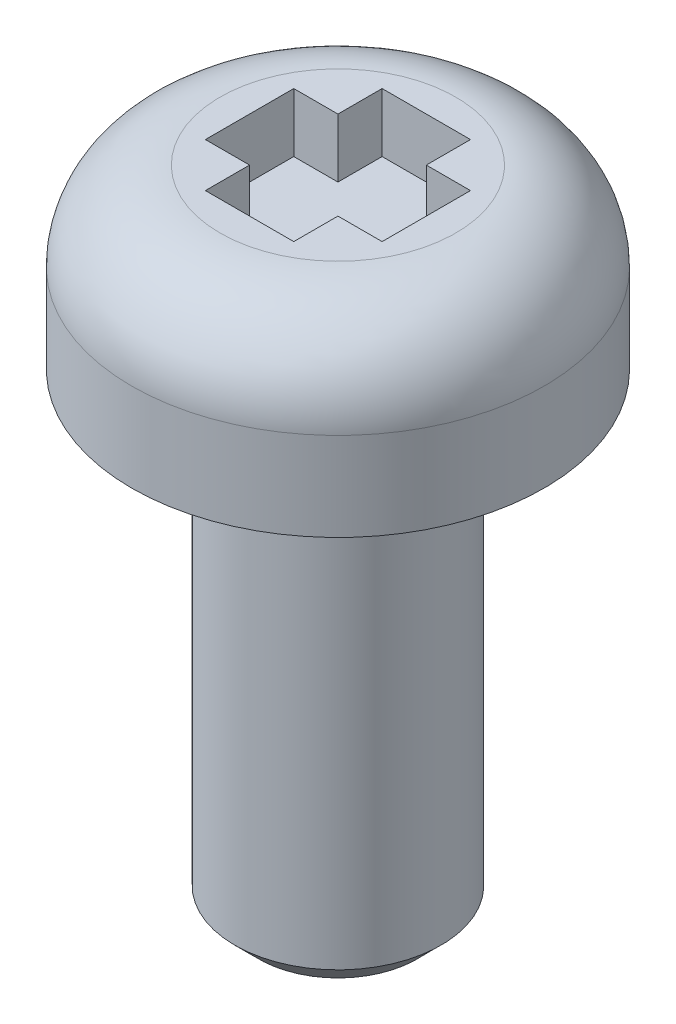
ISO-10303-21;
HEADER;
FILE_DESCRIPTION(('STEP AP214'),'2;1');
FILE_NAME('part.step','',(''),(''),'','','');
FILE_SCHEMA(('AUTOMOTIVE_DESIGN { 1 0 10303 214 1 1 1 1 }'));
ENDSEC;
DATA;
#1=APPLICATION_CONTEXT('core data for automotive mechanical design processes');
#2=APPLICATION_PROTOCOL_DEFINITION('international standard','automotive_design',2000,#1);
#3=PRODUCT_CONTEXT('',#1,'mechanical');
#4=PRODUCT('Part','Part','',(#3));
#5=PRODUCT_RELATED_PRODUCT_CATEGORY('part','',(#4));
#6=PRODUCT_DEFINITION_FORMATION('','',#4);
#7=PRODUCT_DEFINITION_CONTEXT('part definition',#1,'design');
#8=PRODUCT_DEFINITION('design','',#6,#7);
#9=PRODUCT_DEFINITION_SHAPE('','',#8);
#10=(LENGTH_UNIT() NAMED_UNIT(*) SI_UNIT(.MILLI.,.METRE.));
#11=(NAMED_UNIT(*) PLANE_ANGLE_UNIT() SI_UNIT($,.RADIAN.));
#12=(NAMED_UNIT(*) SI_UNIT($,.STERADIAN.) SOLID_ANGLE_UNIT());
#13=UNCERTAINTY_MEASURE_WITH_UNIT(LENGTH_MEASURE(1.E-05),#10,'distance_accuracy_value','');
#14=(GEOMETRIC_REPRESENTATION_CONTEXT(3) GLOBAL_UNCERTAINTY_ASSIGNED_CONTEXT((#13)) GLOBAL_UNIT_ASSIGNED_CONTEXT((#10,
#11,#12)) REPRESENTATION_CONTEXT('',''));
#15=CARTESIAN_POINT('',(0.,0.,0.));
#16=DIRECTION('',(0.,0.,1.));
#17=DIRECTION('',(1.,0.,0.));
#18=AXIS2_PLACEMENT_3D('',#15,#16,#17);
#19=CARTESIAN_POINT('',(-3.5,0.,0.));
#20=DIRECTION('',(0.,1.,0.));
#21=DIRECTION('',(0.,0.,1.));
#22=AXIS2_PLACEMENT_3D('',#19,#20,#21);
#23=PLANE('',#22);
#24=CARTESIAN_POINT('',(0.,0.,0.));
#25=DIRECTION('',(0.,-1.,0.));
#26=DIRECTION('',(0.,0.,1.));
#27=AXIS2_PLACEMENT_3D('',#24,#25,#26);
#28=CIRCLE('',#27,2.2072);
#29=CARTESIAN_POINT('',(0.,0.,2.2072));
#30=VERTEX_POINT('',#29);
#31=EDGE_CURVE('E219',#30,#30,#28,.T.);
#32=ORIENTED_EDGE('',*,*,#31,.F.);
#33=EDGE_LOOP('',(#32));
#34=FACE_BOUND('',#33,.T.);
#35=CARTESIAN_POINT('',(0.,0.,0.));
#36=DIRECTION('',(0.,-1.,0.));
#37=DIRECTION('',(0.,0.,1.));
#38=AXIS2_PLACEMENT_3D('',#35,#36,#37);
#39=CIRCLE('',#38,3.5);
#40=CARTESIAN_POINT('',(0.,0.,3.5));
#41=VERTEX_POINT('',#40);
#42=EDGE_CURVE('E213',#41,#41,#39,.T.);
#43=ORIENTED_EDGE('',*,*,#42,.T.);
#44=EDGE_LOOP('',(#43));
#45=FACE_BOUND('',#44,.T.);
#46=ADVANCED_FACE('F30',(#34,#45),#23,.F.);
#47=CARTESIAN_POINT('',(-0.750000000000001,2.,1.5));
#48=DIRECTION('',(-1.,0.,0.));
#49=DIRECTION('',(0.,0.,-1.));
#50=AXIS2_PLACEMENT_3D('',#47,#48,#49);
#51=PLANE('',#50);
#52=DIRECTION('',(0.,1.,0.));
#53=VECTOR('',#52,1.);
#54=CARTESIAN_POINT('',(-0.75,2.,0.749999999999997));
#55=LINE('',#54,#53);
#56=CARTESIAN_POINT('',(-0.750000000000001,2.,0.749999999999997));
#57=VERTEX_POINT('',#56);
#58=CARTESIAN_POINT('',(-0.75,3.,0.749999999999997));
#59=VERTEX_POINT('',#58);
#60=EDGE_CURVE('E167',#57,#59,#55,.T.);
#61=ORIENTED_EDGE('',*,*,#60,.T.);
#62=DIRECTION('',(0.,0.,-1.));
#63=VECTOR('',#62,1.);
#64=CARTESIAN_POINT('',(-0.750000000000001,3.,1.5));
#65=LINE('',#64,#63);
#66=CARTESIAN_POINT('',(-0.750000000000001,3.,1.5));
#67=VERTEX_POINT('',#66);
#68=EDGE_CURVE('E186',#67,#59,#65,.T.);
#69=ORIENTED_EDGE('',*,*,#68,.F.);
#70=DIRECTION('',(0.,1.,0.));
#71=VECTOR('',#70,1.);
#72=CARTESIAN_POINT('',(-0.750000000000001,2.,1.5));
#73=LINE('',#72,#71);
#74=CARTESIAN_POINT('',(-0.750000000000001,2.,1.5));
#75=VERTEX_POINT('',#74);
#76=EDGE_CURVE('E198',#75,#67,#73,.T.);
#77=ORIENTED_EDGE('',*,*,#76,.F.);
#78=DIRECTION('',(0.,0.,-1.));
#79=VECTOR('',#78,1.);
#80=CARTESIAN_POINT('',(-0.750000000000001,2.,1.5));
#81=LINE('',#80,#79);
#82=EDGE_CURVE('E174',#75,#57,#81,.T.);
#83=ORIENTED_EDGE('',*,*,#82,.T.);
#84=EDGE_LOOP('',(#61,#69,#77,#83));
#85=FACE_BOUND('',#84,.T.);
#86=ADVANCED_FACE('F239',(#85),#51,.F.);
#87=CARTESIAN_POINT('',(0.749999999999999,2.,1.5));
#88=DIRECTION('',(-1.,0.,0.));
#89=DIRECTION('',(0.,0.,-1.));
#90=AXIS2_PLACEMENT_3D('',#87,#88,#89);
#91=PLANE('',#90);
#92=DIRECTION('',(0.,0.,-1.));
#93=VECTOR('',#92,1.);
#94=CARTESIAN_POINT('',(0.749999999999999,2.,1.5));
#95=LINE('',#94,#93);
#96=CARTESIAN_POINT('',(0.749999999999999,2.,1.5));
#97=VERTEX_POINT('',#96);
#98=CARTESIAN_POINT('',(0.75,2.,0.75));
#99=VERTEX_POINT('',#98);
#100=EDGE_CURVE('E181',#97,#99,#95,.T.);
#101=ORIENTED_EDGE('',*,*,#100,.F.);
#102=DIRECTION('',(0.,1.,0.));
#103=VECTOR('',#102,1.);
#104=CARTESIAN_POINT('',(0.749999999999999,2.,1.5));
#105=LINE('',#104,#103);
#106=CARTESIAN_POINT('',(0.749999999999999,3.,1.5));
#107=VERTEX_POINT('',#106);
#108=EDGE_CURVE('E202',#97,#107,#105,.T.);
#109=ORIENTED_EDGE('',*,*,#108,.T.);
#110=DIRECTION('',(0.,0.,-1.));
#111=VECTOR('',#110,1.);
#112=CARTESIAN_POINT('',(0.749999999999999,3.,1.5));
#113=LINE('',#112,#111);
#114=CARTESIAN_POINT('',(0.75,3.,0.750000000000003));
#115=VERTEX_POINT('',#114);
#116=EDGE_CURVE('E193',#107,#115,#113,.T.);
#117=ORIENTED_EDGE('',*,*,#116,.T.);
#118=DIRECTION('',(0.,1.,0.));
#119=VECTOR('',#118,1.);
#120=CARTESIAN_POINT('',(0.75,2.,0.750000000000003));
#121=LINE('',#120,#119);
#122=EDGE_CURVE('E162',#99,#115,#121,.T.);
#123=ORIENTED_EDGE('',*,*,#122,.F.);
#124=EDGE_LOOP('',(#101,#109,#117,#123));
#125=FACE_BOUND('',#124,.T.);
#126=ADVANCED_FACE('F245',(#125),#91,.T.);
#127=CARTESIAN_POINT('',(0.,11.592517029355,0.));
#128=DIRECTION('',(0.,1.,0.));
#129=DIRECTION('',(0.,0.,1.));
#130=AXIS2_PLACEMENT_3D('',#127,#128,#129);
#131=CYLINDRICAL_SURFACE('',#130,3.5);
#132=CARTESIAN_POINT('',(0.,1.5,0.));
#133=DIRECTION('',(0.,-1.,0.));
#134=DIRECTION('',(0.,0.,1.));
#135=AXIS2_PLACEMENT_3D('',#132,#133,#134);
#136=CIRCLE('',#135,3.5);
#137=CARTESIAN_POINT('',(0.,1.5,3.5));
#138=VERTEX_POINT('',#137);
#139=EDGE_CURVE('E210',#138,#138,#136,.T.);
#140=ORIENTED_EDGE('',*,*,#139,.T.);
#141=EDGE_LOOP('',(#140));
#142=FACE_BOUND('',#141,.T.);
#143=ORIENTED_EDGE('',*,*,#42,.F.);
#144=EDGE_LOOP('',(#143));
#145=FACE_BOUND('',#144,.T.);
#146=ADVANCED_FACE('F252',(#142,#145),#131,.T.);
#147=CARTESIAN_POINT('',(0.,1.5,0.));
#148=DIRECTION('',(0.,1.,0.));
#149=DIRECTION('',(0.,0.,1.));
#150=AXIS2_PLACEMENT_3D('',#147,#148,#149);
#151=TOROIDAL_SURFACE('',#150,2.,1.5);
#152=CARTESIAN_POINT('',(0.,3.,0.));
#153=DIRECTION('',(0.,-1.,0.));
#154=DIRECTION('',(0.,0.,1.));
#155=AXIS2_PLACEMENT_3D('',#152,#153,#154);
#156=CIRCLE('',#155,2.);
#157=CARTESIAN_POINT('',(0.,3.,2.));
#158=VERTEX_POINT('',#157);
#159=EDGE_CURVE('E201',#158,#158,#156,.T.);
#160=ORIENTED_EDGE('',*,*,#159,.T.);
#161=EDGE_LOOP('',(#160));
#162=FACE_BOUND('',#161,.T.);
#163=ORIENTED_EDGE('',*,*,#139,.F.);
#164=EDGE_LOOP('',(#163));
#165=FACE_BOUND('',#164,.T.);
#166=ADVANCED_FACE('F255',(#162,#165),#151,.T.);
#167=CARTESIAN_POINT('',(0.,3.,0.));
#168=DIRECTION('',(0.,-1.,0.));
#169=DIRECTION('',(0.,0.,-1.));
#170=AXIS2_PLACEMENT_3D('',#167,#168,#169);
#171=PLANE('',#170);
#172=CARTESIAN_POINT('',(-0.75,3.,-0.750000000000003));
#173=VERTEX_POINT('',#172);
#174=CARTESIAN_POINT('',(-0.75,3.,-1.5));
#175=VERTEX_POINT('',#174);
#176=EDGE_CURVE('E173',#173,#175,#65,.T.);
#177=ORIENTED_EDGE('',*,*,#176,.T.);
#178=DIRECTION('',(-1.,0.,0.));
#179=VECTOR('',#178,1.);
#180=CARTESIAN_POINT('',(0.75,3.,-1.5));
#181=LINE('',#180,#179);
#182=CARTESIAN_POINT('',(0.75,3.,-1.5));
#183=VERTEX_POINT('',#182);
#184=EDGE_CURVE('E189',#183,#175,#181,.T.);
#185=ORIENTED_EDGE('',*,*,#184,.F.);
#186=CARTESIAN_POINT('',(0.75,3.,-0.749999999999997));
#187=VERTEX_POINT('',#186);
#188=EDGE_CURVE('E192',#187,#183,#113,.T.);
#189=ORIENTED_EDGE('',*,*,#188,.F.);
#190=DIRECTION('',(1.,0.,0.));
#191=VECTOR('',#190,1.);
#192=CARTESIAN_POINT('',(-1.5,3.,-0.750000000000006));
#193=LINE('',#192,#191);
#194=CARTESIAN_POINT('',(1.5,3.,-0.749999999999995));
#195=VERTEX_POINT('',#194);
#196=EDGE_CURVE('E153',#187,#195,#193,.T.);
#197=ORIENTED_EDGE('',*,*,#196,.T.);
#198=DIRECTION('',(0.,0.,-1.));
#199=VECTOR('',#198,1.);
#200=CARTESIAN_POINT('',(1.5,3.,0.750000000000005));
#201=LINE('',#200,#199);
#202=CARTESIAN_POINT('',(1.5,3.,0.750000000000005));
#203=VERTEX_POINT('',#202);
#204=EDGE_CURVE('E126',#203,#195,#201,.T.);
#205=ORIENTED_EDGE('',*,*,#204,.F.);
#206=DIRECTION('',(1.,0.,0.));
#207=VECTOR('',#206,1.);
#208=CARTESIAN_POINT('',(-1.5,3.,0.749999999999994));
#209=LINE('',#208,#207);
#210=EDGE_CURVE('E155',#115,#203,#209,.T.);
#211=ORIENTED_EDGE('',*,*,#210,.F.);
#212=ORIENTED_EDGE('',*,*,#116,.F.);
#213=DIRECTION('',(1.,0.,0.));
#214=VECTOR('',#213,1.);
#215=CARTESIAN_POINT('',(-0.750000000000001,3.,1.5));
#216=LINE('',#215,#214);
#217=EDGE_CURVE('E196',#67,#107,#216,.T.);
#218=ORIENTED_EDGE('',*,*,#217,.F.);
#219=ORIENTED_EDGE('',*,*,#68,.T.);
#220=CARTESIAN_POINT('',(-1.5,3.,0.749999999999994));
#221=VERTEX_POINT('',#220);
#222=EDGE_CURVE('E156',#221,#59,#209,.T.);
#223=ORIENTED_EDGE('',*,*,#222,.F.);
#224=DIRECTION('',(0.,0.,1.));
#225=VECTOR('',#224,1.);
#226=CARTESIAN_POINT('',(-1.5,3.,-0.750000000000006));
#227=LINE('',#226,#225);
#228=CARTESIAN_POINT('',(-1.5,3.,-0.750000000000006));
#229=VERTEX_POINT('',#228);
#230=EDGE_CURVE('E140',#229,#221,#227,.T.);
#231=ORIENTED_EDGE('',*,*,#230,.F.);
#232=EDGE_CURVE('E150',#229,#173,#193,.T.);
#233=ORIENTED_EDGE('',*,*,#232,.T.);
#234=EDGE_LOOP('',(#177,#185,#189,#197,#205,#211,#212,#218,#219,#223,#231,#233));
#235=FACE_BOUND('',#234,.T.);
#236=ORIENTED_EDGE('',*,*,#159,.F.);
#237=EDGE_LOOP('',(#236));
#238=FACE_BOUND('',#237,.T.);
#239=ADVANCED_FACE('F259',(#235,#238),#171,.F.);
#240=CARTESIAN_POINT('',(-0.75,2.,-0.75));
#241=VERTEX_POINT('',#240);
#242=CARTESIAN_POINT('',(-0.75,2.,-1.5));
#243=VERTEX_POINT('',#242);
#244=EDGE_CURVE('E178',#241,#243,#81,.T.);
#245=ORIENTED_EDGE('',*,*,#244,.T.);
#246=DIRECTION('',(0.,1.,0.));
#247=VECTOR('',#246,1.);
#248=CARTESIAN_POINT('',(-0.75,2.,-1.5));
#249=LINE('',#248,#247);
#250=EDGE_CURVE('E185',#243,#175,#249,.T.);
#251=ORIENTED_EDGE('',*,*,#250,.T.);
#252=ORIENTED_EDGE('',*,*,#176,.F.);
#253=DIRECTION('',(0.,1.,0.));
#254=VECTOR('',#253,1.);
#255=CARTESIAN_POINT('',(-0.75,2.,-0.750000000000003));
#256=LINE('',#255,#254);
#257=EDGE_CURVE('E171',#241,#173,#256,.T.);
#258=ORIENTED_EDGE('',*,*,#257,.F.);
#259=EDGE_LOOP('',(#245,#251,#252,#258));
#260=FACE_BOUND('',#259,.T.);
#261=ADVANCED_FACE('F248',(#260),#51,.F.);
#262=CARTESIAN_POINT('',(-0.750000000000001,2.,1.5));
#263=DIRECTION('',(0.,0.,-1.));
#264=DIRECTION('',(1.,0.,0.));
#265=AXIS2_PLACEMENT_3D('',#262,#263,#264);
#266=PLANE('',#265);
#267=ORIENTED_EDGE('',*,*,#217,.T.);
#268=ORIENTED_EDGE('',*,*,#108,.F.);
#269=DIRECTION('',(1.,0.,0.));
#270=VECTOR('',#269,1.);
#271=CARTESIAN_POINT('',(-0.750000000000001,2.,1.5));
#272=LINE('',#271,#270);
#273=EDGE_CURVE('E183',#75,#97,#272,.T.);
#274=ORIENTED_EDGE('',*,*,#273,.F.);
#275=ORIENTED_EDGE('',*,*,#76,.T.);
#276=EDGE_LOOP('',(#267,#268,#274,#275));
#277=FACE_BOUND('',#276,.T.);
#278=ADVANCED_FACE('F265',(#277),#266,.T.);
#279=DIRECTION('',(0.,1.,0.));
#280=VECTOR('',#279,1.);
#281=CARTESIAN_POINT('',(0.75,2.,-0.749999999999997));
#282=LINE('',#281,#280);
#283=CARTESIAN_POINT('',(0.75,2.,-0.749999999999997));
#284=VERTEX_POINT('',#283);
#285=EDGE_CURVE('E136',#284,#187,#282,.T.);
#286=ORIENTED_EDGE('',*,*,#285,.T.);
#287=ORIENTED_EDGE('',*,*,#188,.T.);
#288=DIRECTION('',(0.,1.,0.));
#289=VECTOR('',#288,1.);
#290=CARTESIAN_POINT('',(0.75,2.,-1.5));
#291=LINE('',#290,#289);
#292=CARTESIAN_POINT('',(0.75,2.,-1.5));
#293=VERTEX_POINT('',#292);
#294=EDGE_CURVE('E205',#293,#183,#291,.T.);
#295=ORIENTED_EDGE('',*,*,#294,.F.);
#296=EDGE_CURVE('E180',#284,#293,#95,.T.);
#297=ORIENTED_EDGE('',*,*,#296,.F.);
#298=EDGE_LOOP('',(#286,#287,#295,#297));
#299=FACE_BOUND('',#298,.T.);
#300=ADVANCED_FACE('F270',(#299),#91,.T.);
#301=CARTESIAN_POINT('',(0.75,2.,-1.5));
#302=DIRECTION('',(0.,0.,1.));
#303=DIRECTION('',(-1.,0.,0.));
#304=AXIS2_PLACEMENT_3D('',#301,#302,#303);
#305=PLANE('',#304);
#306=ORIENTED_EDGE('',*,*,#184,.T.);
#307=ORIENTED_EDGE('',*,*,#250,.F.);
#308=DIRECTION('',(-1.,0.,0.));
#309=VECTOR('',#308,1.);
#310=CARTESIAN_POINT('',(0.75,2.,-1.5));
#311=LINE('',#310,#309);
#312=EDGE_CURVE('E177',#293,#243,#311,.T.);
#313=ORIENTED_EDGE('',*,*,#312,.F.);
#314=ORIENTED_EDGE('',*,*,#294,.T.);
#315=EDGE_LOOP('',(#306,#307,#313,#314));
#316=FACE_BOUND('',#315,.T.);
#317=ADVANCED_FACE('F267',(#316),#305,.T.);
#318=CARTESIAN_POINT('',(-0.75,2.,-1.5));
#319=DIRECTION('',(0.,-1.,0.));
#320=DIRECTION('',(0.,0.,-1.));
#321=AXIS2_PLACEMENT_3D('',#318,#319,#320);
#322=PLANE('',#321);
#323=ORIENTED_EDGE('',*,*,#296,.T.);
#324=ORIENTED_EDGE('',*,*,#312,.T.);
#325=ORIENTED_EDGE('',*,*,#244,.F.);
#326=DIRECTION('',(1.,0.,0.));
#327=VECTOR('',#326,1.);
#328=CARTESIAN_POINT('',(-1.5,2.,-0.750000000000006));
#329=LINE('',#328,#327);
#330=CARTESIAN_POINT('',(-1.5,2.,-0.750000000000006));
#331=VERTEX_POINT('',#330);
#332=EDGE_CURVE('E53',#331,#241,#329,.T.);
#333=ORIENTED_EDGE('',*,*,#332,.F.);
#334=DIRECTION('',(0.,0.,1.));
#335=VECTOR('',#334,1.);
#336=CARTESIAN_POINT('',(-1.5,2.,-0.750000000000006));
#337=LINE('',#336,#335);
#338=CARTESIAN_POINT('',(-1.5,2.,0.749999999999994));
#339=VERTEX_POINT('',#338);
#340=EDGE_CURVE('E131',#331,#339,#337,.T.);
#341=ORIENTED_EDGE('',*,*,#340,.T.);
#342=DIRECTION('',(1.,0.,0.));
#343=VECTOR('',#342,1.);
#344=CARTESIAN_POINT('',(-1.5,2.,0.749999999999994));
#345=LINE('',#344,#343);
#346=EDGE_CURVE('E145',#339,#57,#345,.T.);
#347=ORIENTED_EDGE('',*,*,#346,.T.);
#348=ORIENTED_EDGE('',*,*,#82,.F.);
#349=ORIENTED_EDGE('',*,*,#273,.T.);
#350=ORIENTED_EDGE('',*,*,#100,.T.);
#351=CARTESIAN_POINT('',(1.5,2.,0.750000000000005));
#352=VERTEX_POINT('',#351);
#353=EDGE_CURVE('E45',#99,#352,#345,.T.);
#354=ORIENTED_EDGE('',*,*,#353,.T.);
#355=DIRECTION('',(0.,0.,-1.));
#356=VECTOR('',#355,1.);
#357=CARTESIAN_POINT('',(1.5,2.,0.750000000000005));
#358=LINE('',#357,#356);
#359=CARTESIAN_POINT('',(1.5,2.,-0.749999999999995));
#360=VERTEX_POINT('',#359);
#361=EDGE_CURVE('E124',#352,#360,#358,.T.);
#362=ORIENTED_EDGE('',*,*,#361,.T.);
#363=EDGE_CURVE('E134',#284,#360,#329,.T.);
#364=ORIENTED_EDGE('',*,*,#363,.F.);
#365=EDGE_LOOP('',(#323,#324,#325,#333,#341,#347,#348,#349,#350,#354,#362,#364));
#366=FACE_BOUND('',#365,.T.);
#367=ADVANCED_FACE('F142',(#366),#322,.F.);
#368=CARTESIAN_POINT('',(-1.5,2.,0.749999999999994));
#369=DIRECTION('',(0.,0.,-1.));
#370=DIRECTION('',(1.,0.,0.));
#371=AXIS2_PLACEMENT_3D('',#368,#369,#370);
#372=PLANE('',#371);
#373=ORIENTED_EDGE('',*,*,#353,.F.);
#374=ORIENTED_EDGE('',*,*,#122,.T.);
#375=ORIENTED_EDGE('',*,*,#210,.T.);
#376=DIRECTION('',(0.,1.,0.));
#377=VECTOR('',#376,1.);
#378=CARTESIAN_POINT('',(1.5,2.,0.750000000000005));
#379=LINE('',#378,#377);
#380=EDGE_CURVE('E130',#352,#203,#379,.T.);
#381=ORIENTED_EDGE('',*,*,#380,.F.);
#382=EDGE_LOOP('',(#373,#374,#375,#381));
#383=FACE_BOUND('',#382,.T.);
#384=ADVANCED_FACE('F280',(#383),#372,.T.);
#385=CARTESIAN_POINT('',(-1.5,2.,-0.750000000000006));
#386=DIRECTION('',(0.,0.,-1.));
#387=DIRECTION('',(1.,0.,0.));
#388=AXIS2_PLACEMENT_3D('',#385,#386,#387);
#389=PLANE('',#388);
#390=ORIENTED_EDGE('',*,*,#285,.F.);
#391=ORIENTED_EDGE('',*,*,#363,.T.);
#392=DIRECTION('',(0.,1.,0.));
#393=VECTOR('',#392,1.);
#394=CARTESIAN_POINT('',(1.5,2.,-0.749999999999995));
#395=LINE('',#394,#393);
#396=EDGE_CURVE('E120',#360,#195,#395,.T.);
#397=ORIENTED_EDGE('',*,*,#396,.T.);
#398=ORIENTED_EDGE('',*,*,#196,.F.);
#399=EDGE_LOOP('',(#390,#391,#397,#398));
#400=FACE_BOUND('',#399,.T.);
#401=ADVANCED_FACE('F135',(#400),#389,.F.);
#402=CARTESIAN_POINT('',(1.5,2.,0.750000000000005));
#403=DIRECTION('',(-1.,0.,0.));
#404=DIRECTION('',(0.,0.,-1.));
#405=AXIS2_PLACEMENT_3D('',#402,#403,#404);
#406=PLANE('',#405);
#407=ORIENTED_EDGE('',*,*,#204,.T.);
#408=ORIENTED_EDGE('',*,*,#396,.F.);
#409=ORIENTED_EDGE('',*,*,#361,.F.);
#410=ORIENTED_EDGE('',*,*,#380,.T.);
#411=EDGE_LOOP('',(#407,#408,#409,#410));
#412=FACE_BOUND('',#411,.T.);
#413=ADVANCED_FACE('F122',(#412),#406,.T.);
#414=ORIENTED_EDGE('',*,*,#332,.T.);
#415=ORIENTED_EDGE('',*,*,#257,.T.);
#416=ORIENTED_EDGE('',*,*,#232,.F.);
#417=DIRECTION('',(0.,1.,0.));
#418=VECTOR('',#417,1.);
#419=CARTESIAN_POINT('',(-1.5,2.,-0.750000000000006));
#420=LINE('',#419,#418);
#421=EDGE_CURVE('E160',#331,#229,#420,.T.);
#422=ORIENTED_EDGE('',*,*,#421,.F.);
#423=EDGE_LOOP('',(#414,#415,#416,#422));
#424=FACE_BOUND('',#423,.T.);
#425=ADVANCED_FACE('F283',(#424),#389,.F.);
#426=ORIENTED_EDGE('',*,*,#60,.F.);
#427=ORIENTED_EDGE('',*,*,#346,.F.);
#428=DIRECTION('',(0.,1.,0.));
#429=VECTOR('',#428,1.);
#430=CARTESIAN_POINT('',(-1.5,2.,0.749999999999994));
#431=LINE('',#430,#429);
#432=EDGE_CURVE('E163',#339,#221,#431,.T.);
#433=ORIENTED_EDGE('',*,*,#432,.T.);
#434=ORIENTED_EDGE('',*,*,#222,.T.);
#435=EDGE_LOOP('',(#426,#427,#433,#434));
#436=FACE_BOUND('',#435,.T.);
#437=ADVANCED_FACE('F288',(#436),#372,.T.);
#438=CARTESIAN_POINT('',(-1.5,2.,-0.750000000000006));
#439=DIRECTION('',(1.,0.,0.));
#440=DIRECTION('',(0.,0.,1.));
#441=AXIS2_PLACEMENT_3D('',#438,#439,#440);
#442=PLANE('',#441);
#443=ORIENTED_EDGE('',*,*,#230,.T.);
#444=ORIENTED_EDGE('',*,*,#432,.F.);
#445=ORIENTED_EDGE('',*,*,#340,.F.);
#446=ORIENTED_EDGE('',*,*,#421,.T.);
#447=EDGE_LOOP('',(#443,#444,#445,#446));
#448=FACE_BOUND('',#447,.T.);
#449=ADVANCED_FACE('F235',(#448),#442,.T.);
#450=CARTESIAN_POINT('',(0.,-8.,0.));
#451=DIRECTION('',(0.,1.,0.));
#452=DIRECTION('',(0.,0.,1.));
#453=AXIS2_PLACEMENT_3D('',#450,#451,#452);
#454=CYLINDRICAL_SURFACE('',#453,1.75);
#455=CARTESIAN_POINT('',(0.,-7.5936,0.));
#456=DIRECTION('',(0.,1.,0.));
#457=DIRECTION('',(0.,0.,-1.));
#458=AXIS2_PLACEMENT_3D('',#455,#456,#457);
#459=CIRCLE('',#458,1.75);
#460=CARTESIAN_POINT('',(0.,-7.5936,-1.75));
#461=VERTEX_POINT('',#460);
#462=EDGE_CURVE('E11',#461,#461,#459,.F.);
#463=ORIENTED_EDGE('',*,*,#462,.F.);
#464=EDGE_LOOP('',(#463));
#465=FACE_BOUND('',#464,.T.);
#466=CARTESIAN_POINT('',(0.,-0.4572,0.));
#467=DIRECTION('',(0.,-1.,0.));
#468=DIRECTION('',(0.,0.,1.));
#469=AXIS2_PLACEMENT_3D('',#466,#467,#468);
#470=CIRCLE('',#469,1.75);
#471=CARTESIAN_POINT('',(0.,-0.4572,1.75));
#472=VERTEX_POINT('',#471);
#473=EDGE_CURVE('E216',#472,#472,#470,.F.);
#474=ORIENTED_EDGE('',*,*,#473,.F.);
#475=EDGE_LOOP('',(#474));
#476=FACE_BOUND('',#475,.T.);
#477=ADVANCED_FACE('F228',(#465,#476),#454,.T.);
#478=CARTESIAN_POINT('',(0.,-8.,0.));
#479=DIRECTION('',(0.,-1.,0.));
#480=DIRECTION('',(0.,0.,-1.));
#481=AXIS2_PLACEMENT_3D('',#478,#479,#480);
#482=PLANE('',#481);
#483=CARTESIAN_POINT('',(0.,-8.,0.));
#484=DIRECTION('',(0.,1.,0.));
#485=DIRECTION('',(0.,0.,-1.));
#486=AXIS2_PLACEMENT_3D('',#483,#484,#485);
#487=CIRCLE('',#486,1.3436);
#488=CARTESIAN_POINT('',(0.,-8.,-1.3436));
#489=VERTEX_POINT('',#488);
#490=EDGE_CURVE('E38',#489,#489,#487,.T.);
#491=ORIENTED_EDGE('',*,*,#490,.F.);
#492=EDGE_LOOP('',(#491));
#493=FACE_BOUND('',#492,.T.);
#494=ADVANCED_FACE('F225',(#493),#482,.T.);
#495=CARTESIAN_POINT('',(0.,-0.4572,0.));
#496=DIRECTION('',(0.,1.,0.));
#497=DIRECTION('',(0.,0.,1.));
#498=AXIS2_PLACEMENT_3D('',#495,#496,#497);
#499=TOROIDAL_SURFACE('',#498,2.2072,0.4572);
#500=ORIENTED_EDGE('',*,*,#31,.T.);
#501=EDGE_LOOP('',(#500));
#502=FACE_BOUND('',#501,.T.);
#503=ORIENTED_EDGE('',*,*,#473,.T.);
#504=EDGE_LOOP('',(#503));
#505=FACE_BOUND('',#504,.T.);
#506=ADVANCED_FACE('F227',(#502,#505),#499,.F.);
#507=CARTESIAN_POINT('',(0.,-8.,0.));
#508=DIRECTION('',(0.,1.,0.));
#509=DIRECTION('',(0.,0.,1.));
#510=AXIS2_PLACEMENT_3D('',#507,#508,#509);
#511=CONICAL_SURFACE('',#510,1.3436,0.785398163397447);
#512=ORIENTED_EDGE('',*,*,#462,.T.);
#513=EDGE_LOOP('',(#512));
#514=FACE_BOUND('',#513,.T.);
#515=ORIENTED_EDGE('',*,*,#490,.T.);
#516=EDGE_LOOP('',(#515));
#517=FACE_BOUND('',#516,.T.);
#518=ADVANCED_FACE('F32',(#514,#517),#511,.T.);
#519=CLOSED_SHELL('',(#46,#86,#126,#146,#166,#239,#261,#278,#300,#317,#367,#384,#401,#413,#425,
#437,#449,#477,#494,#506,#518));
#520=MANIFOLD_SOLID_BREP('B2',#519);
#521=ADVANCED_BREP_SHAPE_REPRESENTATION('',(#18,#520),#14);
#522=SHAPE_DEFINITION_REPRESENTATION(#9,#521);
ENDSEC;
END-ISO-10303-21;
